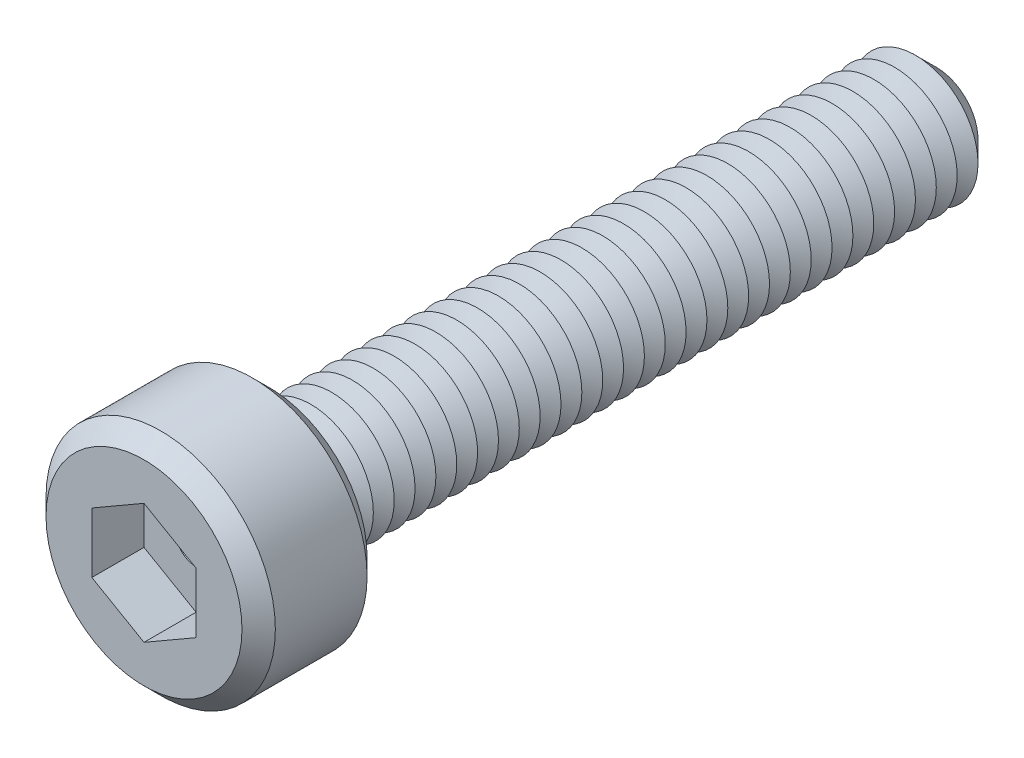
from build123d import *

# Parameters (mm, degrees)
SKETCH1_R           = 2.75
BOSS_EXTRUDE1_DEPTH = 3
SKETCH2_R           = 1.5
BOSS_EXTRUDE2_DEPTH = 16
CHAMFER1_SIZE       = 0.5
LPATTERN1_COUNT     = 31
LPATTERN1_PITCH     = 0.5
CUT_EXTRUDE1_DEPTH  = 1.25
SKETCH6_R           = 0.5
CUT_EXTRUDE2_DEPTH  = 17.75
CHAMFER2_SIZE       = 0.4


with BuildPart() as part:
    # Sketch1 → Boss-Extrude1 (new body)
    with BuildSketch(Plane.XY):
        Circle(SKETCH1_R)
    extrude(amount=BOSS_EXTRUDE1_DEPTH)

    # Sketch2 → Boss-Extrude2 (add)
    with BuildSketch(Plane(origin=(0, 0, 0), x_dir=(-1, 0, 0), z_dir=(0, 0, -1))):
        Circle(SKETCH2_R)
    extrude(amount=BOSS_EXTRUDE2_DEPTH)

    # Chamfer1
    chamfer1_edges = [part.edges().sort_by_distance(p)[0] for p in [
        (1.5, 0, -16),
    ]]
    chamfer(chamfer1_edges, length=CHAMFER1_SIZE)

    # Sketch4 → Cut-Revolve1 (revolve, cut)
    with BuildSketch(Plane(origin=(0, 0, 0), x_dir=(0, 0, -1), z_dir=(1, 0, 0)), mode=Mode.PRIVATE) as cut_revolve1_sk:
        Polygon((0, 1.5), (0.25, 1.066987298), (0.5, 1.5), align=None)
    cut_revolve1 = revolve(cut_revolve1_sk.sketch.rotate(Axis((0, 0, 2.512122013), (0, 0, -1)), 90), axis=Axis((0, 0, 2.512122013), (0, 0, -1)), mode=Mode.SUBTRACT)

    # LPattern1: Cut-Revolve1 ×31
    with Locations(*[(0, 0, -i * LPATTERN1_PITCH) for i in range(1, LPATTERN1_COUNT)]):
        add(cut_revolve1, mode=Mode.SUBTRACT)

    # Sketch5 → Cut-Extrude1 (cut)
    with BuildSketch(Plane.XY.offset(3)):
        Polygon((0, 1.443375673), (-1.25, 0.721687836), (-1.25, -0.721687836), (0, -1.443375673), (1.25, -0.721687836), (1.25, 0.721687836), align=None)
    extrude(amount=-CUT_EXTRUDE1_DEPTH, mode=Mode.SUBTRACT)

    # Sketch6 → Cut-Extrude2 (cut)
    with BuildSketch(Plane.XY.offset(1.75)):
        Circle(SKETCH6_R)
    extrude(amount=-CUT_EXTRUDE2_DEPTH, mode=Mode.SUBTRACT)

    # Chamfer2
    chamfer2_edges = [part.edges().sort_by_distance(p)[0] for p in [
        (-2.75, 0, 0),
        (-2.75, 0, 3),
    ]]
    chamfer(chamfer2_edges, length=CHAMFER2_SIZE)


solid = part.part
